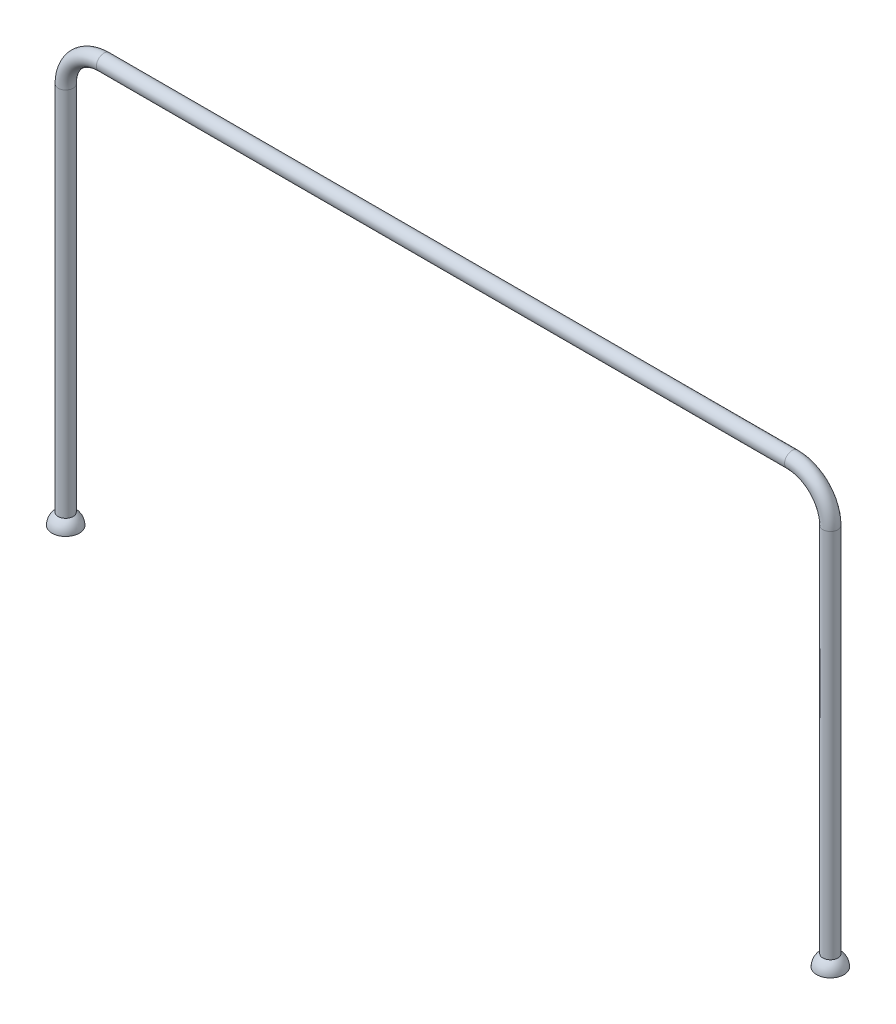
from build123d import *

# Parameters (mm, degrees)
SKETCH2_R               = 1.375
CUT_EXTRUDE1_REACH      = 108.795
CUT_EXTRUDE1_END_RADIUS = 1.375
SKETCH4_R               = 0.9


with BuildPart() as part:
    # Sweep1: sweep along a path in Sketch1
    with BuildLine(Plane.XY) as sweep1_path:
        Line((70, 0), (70, 70))
        ThreePointArc((70, 70), (67.949747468, 74.949747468), (63, 77))
        Line((63, 77), (-63, 77))
        ThreePointArc((-63, 77), (-67.949747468, 74.949747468), (-70, 70))
        Line((-70, 70), (-70, 0))
    # Sketch2 → Sweep1 (sweep)
    with BuildSketch(Plane(origin=(0, 0, 0), x_dir=(1, 0, 0), z_dir=(0, 1, 0))):
        with Locations((70, 0)):
            Circle(SKETCH2_R)
    sweep(path=sweep1_path.line)

    # Sketch3 → Revolve1 (revolve)
    with BuildSketch(Plane.XY, mode=Mode.PRIVATE) as revolve1_sk:
        with BuildLine():
            Line((-72.5, 0), (-70, 0))
            Line((-70, 0), (-70, 2.5))
            ThreePointArc((-70, 2.5), (-71.767766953, 1.767766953), (-72.5, 0))
        make_face()
    revolve1 = revolve(revolve1_sk.sketch.rotate(Axis((-70, -3.414648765, 0), (0, 1, 0)), 270), axis=Axis((-70, -3.414648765, 0), (0, 1, 0)))

    # Mirror1: Revolve1 across plane
    add(revolve1.mirror(Plane(origin=(0, 0, 0), x_dir=(0, 0, 1), z_dir=(1, 0, 0))))

    # Cut-Extrude1: up to this cylinder (the profile starts inside it)
    cut_extrude1_end = Plane(origin=(0, 77, 0), z_dir=(-1, 0, 0)) * Cylinder(CUT_EXTRUDE1_END_RADIUS, 329.34, mode=Mode.PRIVATE)
    # Sketch4 → Cut-Extrude1 (cut, up to the surface)
    with BuildSketch(Plane.XY, mode=Mode.PRIVATE) as cut_extrude1_sk1:
        with Locations((-54, 77)):
            Circle(SKETCH4_R)
    cut_extrude1_tool1 = extrude(cut_extrude1_sk1.sketch, amount=-CUT_EXTRUDE1_REACH, mode=Mode.PRIVATE) & cut_extrude1_end
    add(cut_extrude1_tool1.solids().sort_by_distance((-54, 77, 0))[0], mode=Mode.SUBTRACT)
    # Sketch4 → Cut-Extrude1 (cut, up to the surface)
    with BuildSketch(Plane.XY, mode=Mode.PRIVATE) as cut_extrude1_sk2:
        with Locations((-36, 77)):
            Circle(SKETCH4_R)
    cut_extrude1_tool2 = extrude(cut_extrude1_sk2.sketch, amount=-CUT_EXTRUDE1_REACH, mode=Mode.PRIVATE) & cut_extrude1_end
    add(cut_extrude1_tool2.solids().sort_by_distance((-36, 77, 0))[0], mode=Mode.SUBTRACT)
    # Sketch4 → Cut-Extrude1 (cut, up to the surface)
    with BuildSketch(Plane.XY, mode=Mode.PRIVATE) as cut_extrude1_sk3:
        with Locations((-18, 77)):
            Circle(SKETCH4_R)
    cut_extrude1_tool3 = extrude(cut_extrude1_sk3.sketch, amount=-CUT_EXTRUDE1_REACH, mode=Mode.PRIVATE) & cut_extrude1_end
    add(cut_extrude1_tool3.solids().sort_by_distance((-18, 77, 0))[0], mode=Mode.SUBTRACT)
    # Sketch4 → Cut-Extrude1 (cut, up to the surface)
    with BuildSketch(Plane.XY, mode=Mode.PRIVATE) as cut_extrude1_sk4:
        with Locations((0, 77)):
            Circle(SKETCH4_R)
    cut_extrude1_tool4 = extrude(cut_extrude1_sk4.sketch, amount=-CUT_EXTRUDE1_REACH, mode=Mode.PRIVATE) & cut_extrude1_end
    add(cut_extrude1_tool4.solids().sort_by_distance((0, 77, 0))[0], mode=Mode.SUBTRACT)
    # Sketch4 → Cut-Extrude1 (cut, up to the surface)
    with BuildSketch(Plane.XY, mode=Mode.PRIVATE) as cut_extrude1_sk5:
        with Locations((18, 77)):
            Circle(SKETCH4_R)
    cut_extrude1_tool5 = extrude(cut_extrude1_sk5.sketch, amount=-CUT_EXTRUDE1_REACH, mode=Mode.PRIVATE) & cut_extrude1_end
    add(cut_extrude1_tool5.solids().sort_by_distance((18, 77, 0))[0], mode=Mode.SUBTRACT)
    # Sketch4 → Cut-Extrude1 (cut, up to the surface)
    with BuildSketch(Plane.XY, mode=Mode.PRIVATE) as cut_extrude1_sk6:
        with Locations((36, 77)):
            Circle(SKETCH4_R)
    cut_extrude1_tool6 = extrude(cut_extrude1_sk6.sketch, amount=-CUT_EXTRUDE1_REACH, mode=Mode.PRIVATE) & cut_extrude1_end
    add(cut_extrude1_tool6.solids().sort_by_distance((36, 77, 0))[0], mode=Mode.SUBTRACT)
    # Sketch4 → Cut-Extrude1 (cut, up to the surface)
    with BuildSketch(Plane.XY, mode=Mode.PRIVATE) as cut_extrude1_sk7:
        with Locations((54, 77)):
            Circle(SKETCH4_R)
    cut_extrude1_tool7 = extrude(cut_extrude1_sk7.sketch, amount=-CUT_EXTRUDE1_REACH, mode=Mode.PRIVATE) & cut_extrude1_end
    add(cut_extrude1_tool7.solids().sort_by_distance((54, 77, 0))[0], mode=Mode.SUBTRACT)


solid = part.part
